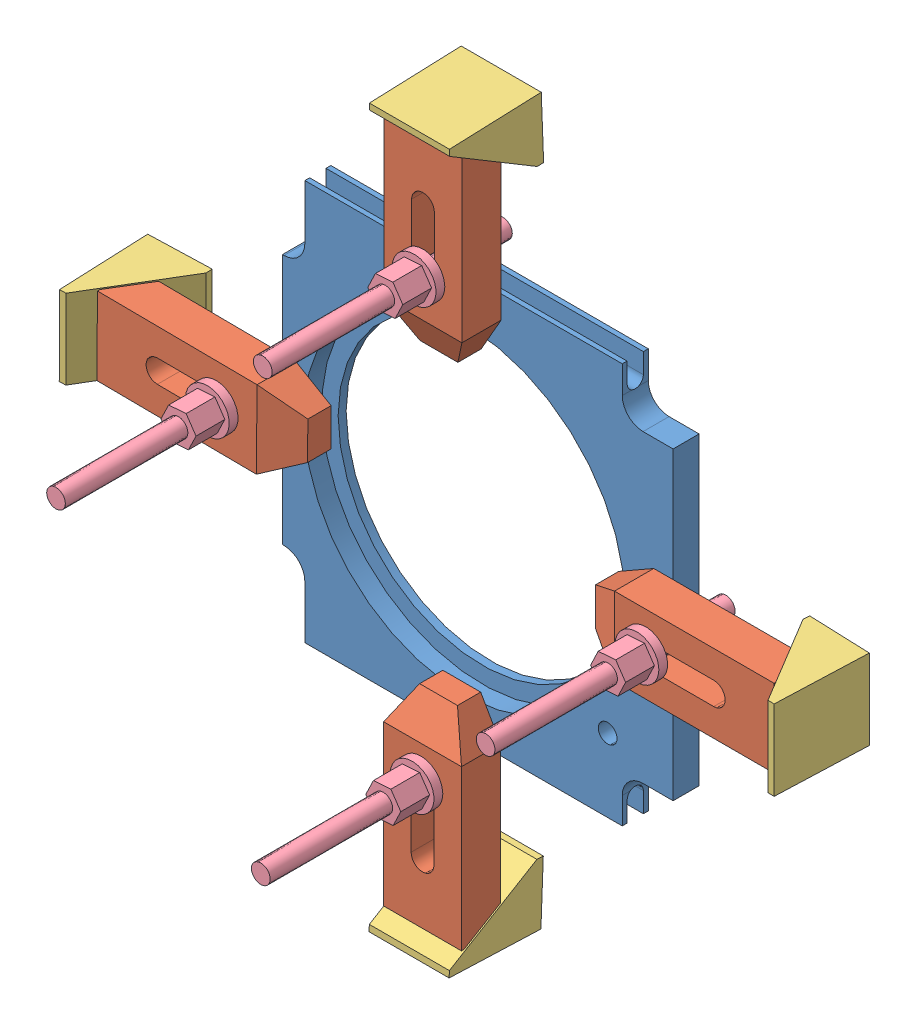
SolidWorks assembly Fixture-undercut-3D.SLDASM, configuration All clamps (file format 13000). Lengths in mm.
Overall size (229.08 230.14 136.1).
13 component instances, 4 part files, 8 mates.
Components (placement in the parent):
- Fixture-undercut-part-1: Fixture-undercut-part.SLDPRT [Default] at (57.186 0 0) x (0 0 1) z (-1 0 0) size (8.26 127 123.95)
- Short-clamp-toe-2: Short-clamp-toe.SLDPRT [Default] at (59.2079 6.7742 10.9361) x (0 1 0) z (0 0 1) size (61.72 24.71 12.45)
- Short-clamp-toe-4: Short-clamp-toe.SLDPRT [Default] at (59.2177 -2.1506 11.0836) x (0 -1 0) z (0 0 1) size (61.72 24.71 12.45)
- Short-clamp-wedge-2: Short-clamp-wedge.SLDPRT [Default] at (46.6068 0.0427 -5.5453) x (0 0.038151 0.999272) z (1 0 0) size (29.14 19.72 25.4)
- Short-clamp-wedge-3: Short-clamp-wedge.SLDPRT [Default] at (72.2619 4.7581 -5.3977) x (0 -0.038151 0.999272) z (-1 0 0) size (29.14 19.72 25.4)
- Short-clamp-bolt-3: Short-clamp-bolt.SLDPRT [Default] at (-10.9915 73.142 23.3821) size (13.89 13.89 76.2)
- Short-clamp-bolt-4: Short-clamp-bolt.SLDPRT [Default] at (-11.4778 -66.3426 23.5296) size (13.89 13.89 76.2)
- Short-clamp-toe-1: Short-clamp-toe.SLDPRT [Default] at (63.63 1.5156 8.3277) size (61.72 24.71 12.45)
- Short-clamp-toe-3: Short-clamp-toe.SLDPRT [Default] at (57.6843 1.1605 8.431) x (-0.999962 0.008727 0) z (0 0 1) size (61.72 24.71 12.45)
- Short-clamp-wedge-1: Short-clamp-wedge.SLDPRT [Default] at (62.4804 -11.1414 -6.5623) x (-0.038151 0 0.999272) z (0 1 0) size (29.14 19.72 25.4)
- Short-clamp-wedge-4: Short-clamp-wedge.SLDPRT [Default] at (58.9859 14.2162 -6.5221) x (0.03812 -0.004212 0.999264) z (-0.006342 -0.999972 -0.003973) size (29.14 19.72 25.4)
- Short-clamp-bolt-1: Short-clamp-bolt.SLDPRT [Default] at (-79.0962 1.7202 20.877) size (13.89 13.89 76.2)
- Short-clamp-bolt-2: Short-clamp-bolt.SLDPRT [Default] at (57.0997 2.0951 20.7737) size (13.89 13.89 76.2)
Mates (geometry in assembly coordinates):
- Coincident3: coincident anti-aligned: plane of Short-clamp-toe-3 through (-46.7775 -10.2854 20.0702) normal (-0.857411 0.007483 -0.514578); plane of Short-clamp-wedge-4 through (-50.7738 -10.6204 26.724) normal (0.857411 -0.007483 0.514578)
- Coincident4: coincident anti-aligned: plane of Short-clamp-toe-4 through (71.5748 -106.5086 22.7228) normal (0 -0.857444 -0.514578); plane of Short-clamp-wedge-2 through (72.0068 -109.5571 27.8025) normal (0 0.857444 0.514578)
- Coincident5: coincident anti-aligned: plane of Short-clamp-toe-1 through (167.988 13.8727 19.9668) normal (0.857444 0 -0.514578); plane of Short-clamp-wedge-1 through (172.0801 14.2586 26.7855) normal (-0.857444 0 0.514578)
- Coincident6: coincident anti-aligned: plane of Short-clamp-toe-2 through (46.8508 111.1321 22.5752) normal (0 0.857444 -0.514578); plane of Short-clamp-wedge-3 through (46.8619 114.3578 27.9502) normal (0 -0.857444 0.514578)
- Coincident7: coincident anti-aligned: plane of Short-clamp-toe-4 through (59.2177 -2.1506 23.5296) normal (0 0 1); plane of Short-clamp-bolt-4 through (58.6971 -66.3426 23.5296) normal (0 0 -1)
- Coincident8: coincident anti-aligned: plane of Short-clamp-toe-3 through (57.6843 1.1605 20.877) normal (0 0 1); plane of Short-clamp-bolt-1 through (-8.9214 1.7202 20.877) normal (0 0 -1)
- Coincident9: coincident anti-aligned: plane of Short-clamp-toe-2 through (59.2079 6.7742 23.3821) normal (0 0 1); plane of Short-clamp-bolt-3 through (59.1834 73.142 23.3821) normal (0 0 -1)
- Coincident10: coincident anti-aligned: plane of Short-clamp-toe-1 through (63.63 1.5156 20.7737) normal (0 0 1); plane of Short-clamp-bolt-2 through (127.2745 2.0951 20.7737) normal (0 0 -1)
